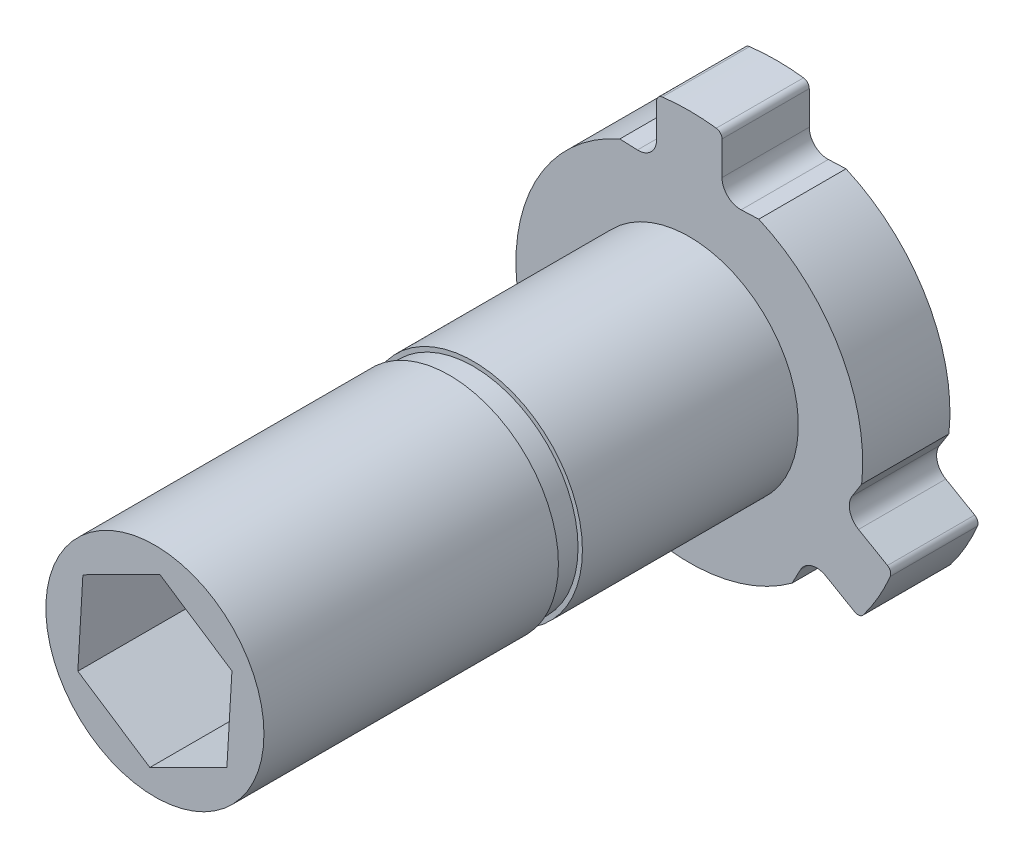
from build123d import *

# Parameters (mm, degrees)
ESQUISSE1_R              = 5
EXTRUSION1_DEPTH         = 24.5
ENL_V_MAT_EXTRU_1_DEPTH  = 11
ESQUISSE4_R              = 10
EXTRUSION2_DEPTH         = 4
ESQUISSE5_OUTSIDE_W      = 30.03
ESQUISSE5_OUTSIDE_H      = 30.03
ENL_V_MAT_EXTRU_3_DEPTH  = 32.81587654
ESQUISSE6_R              = 0.545651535
ENL_V_MAT_EXTRU_4_DEPTH  = 1
CONG_2_R                 = 0.3
ENL_V_START              = -1.1
ESQUISSE21_R             = 5
ESQUISSE21_R_2           = 4.8
ENL_V_MAT_EXTRU_11_DEPTH = 1.1


with BuildPart() as part:
    # Esquisse1 → Extrusion1 (new body)
    with BuildSketch(Plane.XY):
        Circle(ESQUISSE1_R)
    extrude(amount=EXTRUSION1_DEPTH)

    # Esquisse2 → Enl_v. mat.-Extru.1 (cut)
    with BuildSketch(Plane.XY.offset(24.5)):
        Polygon((3.300533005, -2.17302173), (3.532158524, 1.771834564), (0.231625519, 3.944856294), (-3.300533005, 2.17302173), (-3.532158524, -1.771834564), (-0.231625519, -3.944856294), align=None)
    extrude(amount=-ENL_V_MAT_EXTRU_1_DEPTH, mode=Mode.SUBTRACT)

    # Esquisse4 → Extrusion2 (add)
    with BuildSketch(Plane(origin=(0, 0, 0), x_dir=(-1, 0, 0), z_dir=(0, 0, -1))):
        Circle(ESQUISSE4_R)
    extrude(amount=EXTRUSION2_DEPTH)

    # Esquisse5 outside → Enl_v. mat.-Extru.3 (cut, through all)
    with BuildSketch(Plane(origin=(0, 0, -4), x_dir=(-1, 0, 0), z_dir=(0, 0, -1))):
        Rectangle(ESQUISSE5_OUTSIDE_W, ESQUISSE5_OUTSIDE_H)
        with BuildLine():
            Line((-2.376594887, 7.251291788), (-3.18515413, 7.284043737))
            ThreePointArc((-3.18515413, 7.284043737), (-6.88490196, 3.975), (-7.900743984, -0.883597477))
            Line((-7.900743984, -0.883597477), (-7.468100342, -1.567454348))
            ThreePointArc((-7.468100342, -1.567454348), (-7.362040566, -2.219425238), (-7.758828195, -2.747510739))
            Line((-7.758828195, -2.747510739), (-9.312271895, -3.644391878))
            ThreePointArc((-9.312271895, -3.644391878), (-8.660254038, -5), (-7.812271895, -6.242468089))
            Line((-7.812271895, -6.242468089), (-6.258828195, -5.345586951))
            ThreePointArc((-6.258828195, -5.345586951), (-5.603098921, -5.266001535), (-5.091505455, -5.68383744))
            Line((-5.091505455, -5.68383744), (-4.715589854, -6.40044626))
            ThreePointArc((-4.715589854, -6.40044626), (0, -7.95), (4.715589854, -6.40044626))
            Line((4.715589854, -6.40044626), (5.091505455, -5.68383744))
            ThreePointArc((5.091505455, -5.68383744), (5.603098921, -5.266001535), (6.258828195, -5.345586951))
            Line((6.258828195, -5.345586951), (7.812271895, -6.242468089))
            ThreePointArc((7.812271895, -6.242468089), (8.660254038, -5), (9.312271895, -3.644391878))
            Line((9.312271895, -3.644391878), (7.758828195, -2.747510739))
            ThreePointArc((7.758828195, -2.747510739), (7.362040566, -2.219425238), (7.468100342, -1.567454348))
            Line((7.468100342, -1.567454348), (7.900743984, -0.883597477))
            ThreePointArc((7.900743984, -0.883597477), (6.88490196, 3.975), (3.18515413, 7.284043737))
            Line((3.18515413, 7.284043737), (2.376594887, 7.251291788))
            ThreePointArc((2.376594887, 7.251291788), (1.758941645, 7.485426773), (1.5, 8.09309769))
            Line((1.5, 8.09309769), (1.5, 9.886859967))
            ThreePointArc((1.5, 9.886859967), (0, 10), (-1.5, 9.886859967))
            Line((-1.5, 9.886859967), (-1.5, 8.09309769))
            ThreePointArc((-1.5, 8.09309769), (-1.758941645, 7.485426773), (-2.376594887, 7.251291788))
        make_face(mode=Mode.SUBTRACT)
    extrude(amount=-ENL_V_MAT_EXTRU_3_DEPTH, mode=Mode.SUBTRACT)

    # Esquisse6 → Enl_v. mat.-Extru.4 (cut)
    with BuildSketch(Plane(origin=(0, 0, -4), x_dir=(-1, 0, 0), z_dir=(0, 0, -1))):
        Circle(ESQUISSE6_R)
    extrude(amount=-ENL_V_MAT_EXTRU_4_DEPTH, mode=Mode.SUBTRACT)

    # Cong_2
    cong_2_edges = [part.edges().sort_by_distance(p)[0] for p in [
        (7.812271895, -6.242468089, -2),
        (9.312271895, -3.644391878, -2),
        (1.5, 9.886859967, -2),
        (-1.5, 9.886859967, -2),
        (-9.312271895, -3.644391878, -2),
        (-7.812271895, -6.242468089, -2),
    ]]
    fillet(cong_2_edges, radius=CONG_2_R)

    # Esquisse21 → Enl_v. mat.-Extru.11 (cut)
    with BuildSketch(Plane.XY.offset(11).offset(ENL_V_START)):
        with Locations(Location((0, 0, 0), (0, 0, 180))):
            Circle(ESQUISSE21_R)
        Circle(ESQUISSE21_R_2, mode=Mode.SUBTRACT)
    extrude(amount=ENL_V_MAT_EXTRU_11_DEPTH, mode=Mode.SUBTRACT)


solid = part.part
